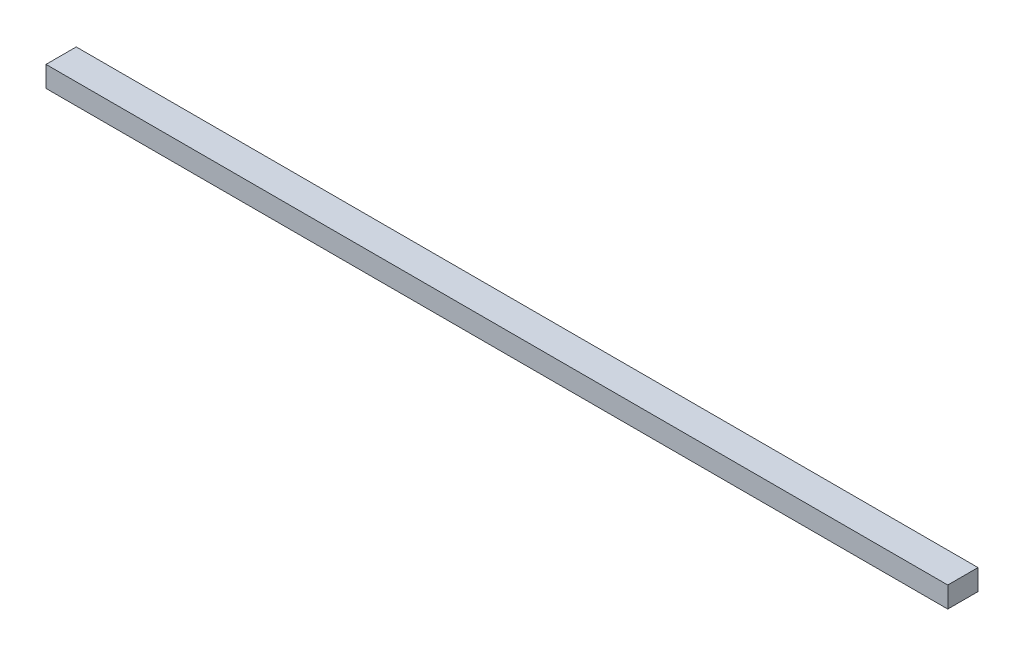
from build123d import *

# Parameters (mm, degrees)
SKETCH1_W           = 549.275
SKETCH1_H           = 18.415
BOSS_EXTRUDE1_DEPTH = 12.7


with BuildPart() as part:
    # Sketch1 → Boss-Extrude1 (new body)
    with BuildSketch(Plane(origin=(0, 0, 0), x_dir=(1, 0, 0), z_dir=(0, 1, 0))):
        Rectangle(SKETCH1_W, SKETCH1_H)
    extrude(amount=BOSS_EXTRUDE1_DEPTH)


solid = part.part
